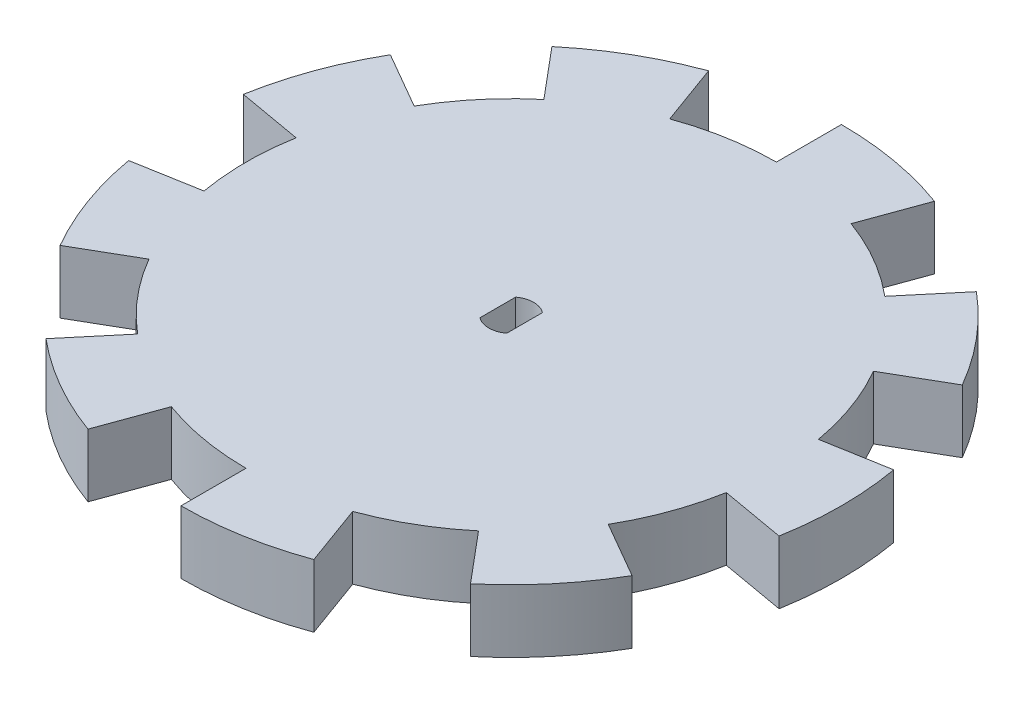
from build123d import *

# Parameters (mm, degrees)
SKETCH1_R              = 41.275
BASIC_FOOTPRINT_DEPTH  = 1.27
SKETCH3_R              = 33.147
QUEUE_HEIGHT_DEPTH     = 6.604
MOTOR_MOUNTING_SIZE    = 1.016
MOTOR_MOUNTING_SIZE2   = 0.981139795
SKETCH5_R              = 28.575
SKETCH5_R_2            = 8.89
SPACE_FOR_SCREWS_DEPTH = 6.35
TEETH_START            = -7.874
TEETH_DEPTH            = 6.604
CUT_EXTRUDE1_DEPTH     = 2.54


with BuildPart() as part:
    # Sketch1 → basic footprint (new body)
    with BuildSketch(Plane(origin=(0, 0, 0), x_dir=(1, 0, 0), z_dir=(0, 1, 0))):
        with Locations(Location((0, 0, 0), (0, 0, 270))):
            Circle(SKETCH1_R)
        with BuildLine():
            ThreePointArc((1.6764, -2.2352), (0, -2.794), (-1.6764, -2.2352))
            Line((-1.6764, -2.2352), (-1.6764, 2.2352))
            ThreePointArc((-1.6764, 2.2352), (0, 2.794), (1.6764, 2.2352))
            Line((1.6764, 2.2352), (1.6764, -2.2352))
        make_face(mode=Mode.SUBTRACT)
    extrude(amount=BASIC_FOOTPRINT_DEPTH)

    # Sketch3 → queue height (add)
    with BuildSketch(Plane(origin=(0, 1.27, 0), x_dir=(1, 0, 0), z_dir=(0, 1, 0))):
        with Locations(Location((0, 0, 0), (0, 0, 90))):
            Circle(SKETCH3_R)
        with BuildLine():
            Line((-1.6764, -2.2352), (-1.6764, 2.2352))
            ThreePointArc((-1.6764, 2.2352), (0, 2.794), (1.6764, 2.2352))
            Line((1.6764, 2.2352), (1.6764, -2.2352))
            ThreePointArc((1.6764, -2.2352), (0, -2.794), (-1.6764, -2.2352))
        make_face(mode=Mode.SUBTRACT)
    extrude(amount=QUEUE_HEIGHT_DEPTH)

    # motor mounting
    motor_mounting_edges = [part.edges().sort_by_distance(p)[0] for p in [
        (-1.6764, 0, 0),
        (0, 0, 2.794),
        (1.6764, 0, 0),
        (0, 0, -2.794),
    ]]
    motor_mounting_side = [part.faces().sort_by_distance(p)[0] for p in [
        (0, 0, -40.107566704),
    ]]
    chamfer(motor_mounting_edges, length=MOTOR_MOUNTING_SIZE, length2=MOTOR_MOUNTING_SIZE2, reference=motor_mounting_side[0])

    # Sketch5 → space for screws (cut)
    with BuildSketch(Plane.XZ):
        with Locations(Location((0, 0, 0), (0, 0, 270))):
            Circle(SKETCH5_R)
        with Locations(Location((0, 0, 0), (0, 0, 270))):
            Circle(SKETCH5_R_2, mode=Mode.SUBTRACT)
    extrude(amount=-SPACE_FOR_SCREWS_DEPTH, mode=Mode.SUBTRACT)

    # Sketch7 → Teeth (add)
    with BuildSketch(Plane.XZ.offset(TEETH_START)):
        with BuildLine():
            Line((0, 41.275), (0, 31.75))
            ThreePointArc((0, 31.75), (5.513329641, 31.267646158), (10.859139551, 29.83524071))
            Line((10.859139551, 29.83524071), (14.116881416, 38.785812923))
            ThreePointArc((14.116881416, 38.785812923), (7.167328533, 40.647940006), (0, 41.275))
        make_face()
        with BuildLine():
            ThreePointArc((-20.408506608, 24.321911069), (-15.875, 27.49630657), (-10.859139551, 29.83524071))
            Line((-10.859139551, 29.83524071), (-14.116881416, 38.785812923))
            ThreePointArc((-14.116881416, 38.785812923), (-20.6375, 35.745198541), (-26.53105859, 31.61848439))
            Line((-26.53105859, 31.61848439), (-20.408506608, 24.321911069))
        make_face()
        with BuildLine():
            Line((26.53105859, 31.61848439), (20.408506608, 24.321911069))
            ThreePointArc((20.408506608, 24.321911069), (24.321911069, 20.408506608), (27.49630657, 15.875))
            Line((27.49630657, 15.875), (35.745198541, 20.6375))
            ThreePointArc((35.745198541, 20.6375), (31.61848439, 26.53105859), (26.53105859, 31.61848439))
        make_face()
        with BuildLine():
            ThreePointArc((-31.267646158, 5.513329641), (-29.83524071, 10.859139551), (-27.49630657, 15.875))
            Line((-27.49630657, 15.875), (-35.745198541, 20.6375))
            ThreePointArc((-35.745198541, 20.6375), (-38.785812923, 14.116881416), (-40.647940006, 7.167328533))
            Line((-40.647940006, 7.167328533), (-31.267646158, 5.513329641))
        make_face()
        with BuildLine():
            Line((40.647940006, 7.167328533), (31.267646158, 5.513329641))
            ThreePointArc((31.267646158, 5.513329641), (31.75, 0), (31.267646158, -5.513329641))
            Line((31.267646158, -5.513329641), (40.647940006, -7.167328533))
            ThreePointArc((40.647940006, -7.167328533), (41.275, 0), (40.647940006, 7.167328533))
        make_face()
        with BuildLine():
            ThreePointArc((-27.49630657, -15.875), (-29.83524071, -10.859139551), (-31.267646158, -5.513329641))
            Line((-31.267646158, -5.513329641), (-40.647940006, -7.167328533))
            ThreePointArc((-40.647940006, -7.167328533), (-38.785812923, -14.116881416), (-35.745198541, -20.6375))
            Line((-35.745198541, -20.6375), (-27.49630657, -15.875))
        make_face()
        with BuildLine():
            Line((35.745198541, -20.6375), (27.49630657, -15.875))
            ThreePointArc((27.49630657, -15.875), (24.321911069, -20.408506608), (20.408506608, -24.321911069))
            Line((20.408506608, -24.321911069), (26.53105859, -31.61848439))
            ThreePointArc((26.53105859, -31.61848439), (31.61848439, -26.53105859), (35.745198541, -20.6375))
        make_face()
        with BuildLine():
            ThreePointArc((-10.859139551, -29.83524071), (-15.875, -27.49630657), (-20.408506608, -24.321911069))
            Line((-20.408506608, -24.321911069), (-26.53105859, -31.61848439))
            ThreePointArc((-26.53105859, -31.61848439), (-20.6375, -35.745198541), (-14.116881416, -38.785812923))
            Line((-14.116881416, -38.785812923), (-10.859139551, -29.83524071))
        make_face()
        with BuildLine():
            Line((14.116881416, -38.785812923), (10.859139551, -29.83524071))
            ThreePointArc((10.859139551, -29.83524071), (5.513329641, -31.267646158), (0, -31.75))
            Line((0, -31.75), (0, -41.275))
            ThreePointArc((0, -41.275), (7.167328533, -40.647940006), (14.116881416, -38.785812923))
        make_face()
    extrude(amount=TEETH_DEPTH)

    # Sketch8 → Cut-Extrude1 (cut)
    with BuildSketch(Plane(origin=(0, 1.27, 0), x_dir=(1, 0, 0), z_dir=(0, 1, 0))):
        with BuildLine():
            Line((0, -41.275), (0, -33.147))
            ThreePointArc((0, -33.147), (-5.755916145, -32.643422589), (-11.336941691, -31.147991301))
            Line((-11.336941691, -31.147991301), (-14.116881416, -38.785812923))
            ThreePointArc((-14.116881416, -38.785812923), (-7.167328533, -40.647940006), (0, -41.275))
        make_face()
        with BuildLine():
            ThreePointArc((21.306480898, -25.392075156), (16.5735, -28.706144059), (11.336941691, -31.147991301))
            Line((11.336941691, -31.147991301), (14.116881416, -38.785812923))
            ThreePointArc((14.116881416, -38.785812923), (20.6375, -35.745198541), (26.53105859, -31.61848439))
            Line((26.53105859, -31.61848439), (21.306480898, -25.392075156))
        make_face()
        with BuildLine():
            Line((-26.53105859, -31.61848439), (-21.306480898, -25.392075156))
            ThreePointArc((-21.306480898, -25.392075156), (-25.392075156, -21.306480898), (-28.706144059, -16.5735))
            Line((-28.706144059, -16.5735), (-35.745198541, -20.6375))
            ThreePointArc((-35.745198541, -20.6375), (-31.61848439, -26.53105859), (-26.53105859, -31.61848439))
        make_face()
        with BuildLine():
            ThreePointArc((32.643422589, -5.755916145), (31.147991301, -11.336941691), (28.706144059, -16.5735))
            Line((28.706144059, -16.5735), (35.745198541, -20.6375))
            ThreePointArc((35.745198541, -20.6375), (38.785812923, -14.116881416), (40.647940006, -7.167328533))
            Line((40.647940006, -7.167328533), (32.643422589, -5.755916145))
        make_face()
        with BuildLine():
            Line((-40.647940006, -7.167328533), (-32.643422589, -5.755916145))
            ThreePointArc((-32.643422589, -5.755916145), (-33.147, 0), (-32.643422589, 5.755916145))
            Line((-32.643422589, 5.755916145), (-40.647940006, 7.167328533))
            ThreePointArc((-40.647940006, 7.167328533), (-41.275, 0), (-40.647940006, -7.167328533))
        make_face()
        with BuildLine():
            Line((-35.745198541, 20.6375), (-28.706144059, 16.5735))
            ThreePointArc((-28.706144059, 16.5735), (-25.392075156, 21.306480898), (-21.306480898, 25.392075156))
            Line((-21.306480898, 25.392075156), (-26.53105859, 31.61848439))
            ThreePointArc((-26.53105859, 31.61848439), (-31.61848439, 26.53105859), (-35.745198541, 20.6375))
        make_face()
        with BuildLine():
            ThreePointArc((28.706144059, 16.5735), (31.147991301, 11.336941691), (32.643422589, 5.755916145))
            Line((32.643422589, 5.755916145), (40.647940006, 7.167328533))
            ThreePointArc((40.647940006, 7.167328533), (38.785812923, 14.116881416), (35.745198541, 20.6375))
            Line((35.745198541, 20.6375), (28.706144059, 16.5735))
        make_face()
        with BuildLine():
            Line((-14.116881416, 38.785812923), (-11.336941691, 31.147991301))
            ThreePointArc((-11.336941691, 31.147991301), (-5.755916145, 32.643422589), (0, 33.147))
            Line((0, 33.147), (0, 41.275))
            ThreePointArc((0, 41.275), (-7.167328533, 40.647940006), (-14.116881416, 38.785812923))
        make_face()
        with BuildLine():
            ThreePointArc((11.336941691, 31.147991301), (16.5735, 28.706144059), (21.306480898, 25.392075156))
            Line((21.306480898, 25.392075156), (26.53105859, 31.61848439))
            ThreePointArc((26.53105859, 31.61848439), (20.6375, 35.745198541), (14.116881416, 38.785812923))
            Line((14.116881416, 38.785812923), (11.336941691, 31.147991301))
        make_face()
    extrude(amount=-CUT_EXTRUDE1_DEPTH, mode=Mode.SUBTRACT)


solid = part.part
